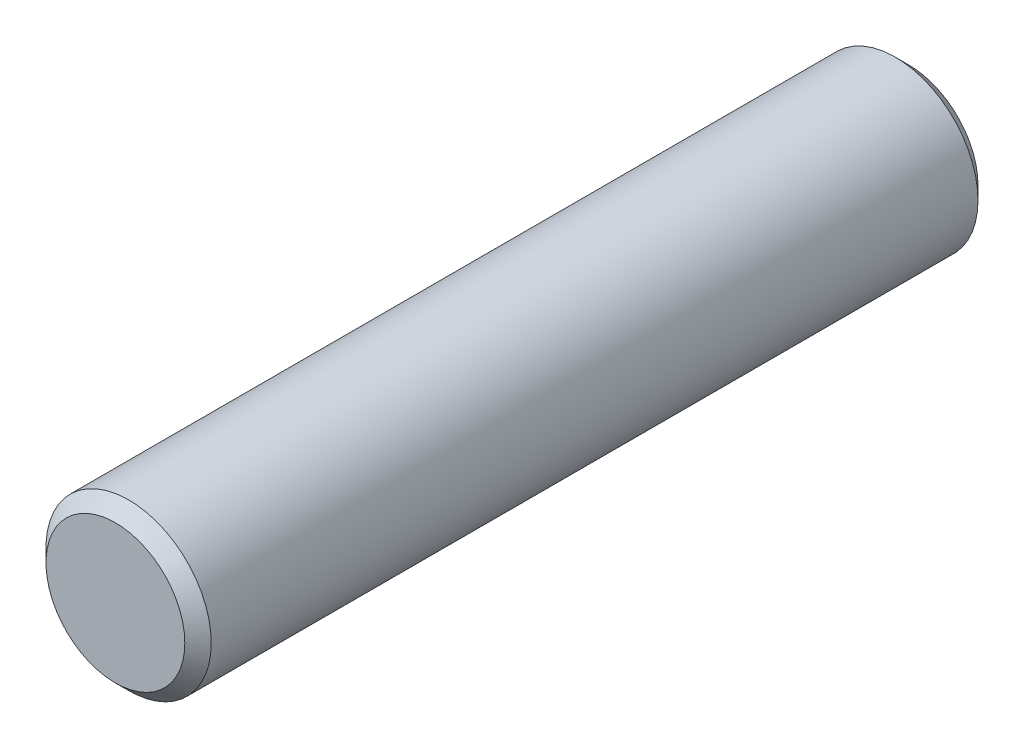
ISO-10303-21;
HEADER;
FILE_DESCRIPTION(('STEP AP214'),'2;1');
FILE_NAME('part.step','',(''),(''),'','','');
FILE_SCHEMA(('AUTOMOTIVE_DESIGN { 1 0 10303 214 1 1 1 1 }'));
ENDSEC;
DATA;
#1=APPLICATION_CONTEXT('core data for automotive mechanical design processes');
#2=APPLICATION_PROTOCOL_DEFINITION('international standard','automotive_design',2000,#1);
#3=PRODUCT_CONTEXT('',#1,'mechanical');
#4=PRODUCT('Part','Part','',(#3));
#5=PRODUCT_RELATED_PRODUCT_CATEGORY('part','',(#4));
#6=PRODUCT_DEFINITION_FORMATION('','',#4);
#7=PRODUCT_DEFINITION_CONTEXT('part definition',#1,'design');
#8=PRODUCT_DEFINITION('design','',#6,#7);
#9=PRODUCT_DEFINITION_SHAPE('','',#8);
#10=(LENGTH_UNIT() NAMED_UNIT(*) SI_UNIT(.MILLI.,.METRE.));
#11=(NAMED_UNIT(*) PLANE_ANGLE_UNIT() SI_UNIT($,.RADIAN.));
#12=(NAMED_UNIT(*) SI_UNIT($,.STERADIAN.) SOLID_ANGLE_UNIT());
#13=UNCERTAINTY_MEASURE_WITH_UNIT(LENGTH_MEASURE(1.E-05),#10,'distance_accuracy_value','');
#14=(GEOMETRIC_REPRESENTATION_CONTEXT(3) GLOBAL_UNCERTAINTY_ASSIGNED_CONTEXT((#13)) GLOBAL_UNIT_ASSIGNED_CONTEXT((#10,
#11,#12)) REPRESENTATION_CONTEXT('',''));
#15=CARTESIAN_POINT('',(0.,0.,0.));
#16=DIRECTION('',(0.,0.,1.));
#17=DIRECTION('',(1.,0.,0.));
#18=AXIS2_PLACEMENT_3D('',#15,#16,#17);
#19=CARTESIAN_POINT('',(0.,0.,-6.));
#20=DIRECTION('',(0.,0.,1.));
#21=DIRECTION('',(1.,0.,0.));
#22=AXIS2_PLACEMENT_3D('',#19,#20,#21);
#23=CYLINDRICAL_SURFACE('',#22,1.25);
#24=CARTESIAN_POINT('',(0.,0.,-5.8));
#25=DIRECTION('',(0.,0.,1.));
#26=DIRECTION('',(1.,0.,0.));
#27=AXIS2_PLACEMENT_3D('',#24,#25,#26);
#28=CIRCLE('',#27,1.25);
#29=CARTESIAN_POINT('',(1.25,0.,-5.8));
#30=VERTEX_POINT('',#29);
#31=EDGE_CURVE('E42',#30,#30,#28,.T.);
#32=ORIENTED_EDGE('',*,*,#31,.T.);
#33=EDGE_LOOP('',(#32));
#34=FACE_BOUND('',#33,.T.);
#35=CARTESIAN_POINT('',(0.,0.,5.8));
#36=DIRECTION('',(0.,0.,1.));
#37=DIRECTION('',(1.,0.,0.));
#38=AXIS2_PLACEMENT_3D('',#35,#36,#37);
#39=CIRCLE('',#38,1.25);
#40=CARTESIAN_POINT('',(1.25,0.,5.8));
#41=VERTEX_POINT('',#40);
#42=EDGE_CURVE('E46',#41,#41,#39,.F.);
#43=ORIENTED_EDGE('',*,*,#42,.T.);
#44=EDGE_LOOP('',(#43));
#45=FACE_BOUND('',#44,.T.);
#46=ADVANCED_FACE('F31',(#34,#45),#23,.T.);
#47=CARTESIAN_POINT('',(0.,0.,-6.));
#48=DIRECTION('',(0.,0.,1.));
#49=DIRECTION('',(1.,0.,0.));
#50=AXIS2_PLACEMENT_3D('',#47,#48,#49);
#51=PLANE('',#50);
#52=CARTESIAN_POINT('',(0.,0.,-6.));
#53=DIRECTION('',(0.,0.,1.));
#54=DIRECTION('',(1.,0.,0.));
#55=AXIS2_PLACEMENT_3D('',#52,#53,#54);
#56=CIRCLE('',#55,1.05);
#57=CARTESIAN_POINT('',(1.05,0.,-6.));
#58=VERTEX_POINT('',#57);
#59=EDGE_CURVE('E38',#58,#58,#56,.F.);
#60=ORIENTED_EDGE('',*,*,#59,.T.);
#61=EDGE_LOOP('',(#60));
#62=FACE_BOUND('',#61,.T.);
#63=ADVANCED_FACE('F62',(#62),#51,.F.);
#64=CARTESIAN_POINT('',(0.,0.,6.));
#65=DIRECTION('',(0.,0.,1.));
#66=DIRECTION('',(1.,0.,0.));
#67=AXIS2_PLACEMENT_3D('',#64,#65,#66);
#68=PLANE('',#67);
#69=CARTESIAN_POINT('',(0.,0.,6.));
#70=DIRECTION('',(0.,0.,1.));
#71=DIRECTION('',(1.,0.,0.));
#72=AXIS2_PLACEMENT_3D('',#69,#70,#71);
#73=CIRCLE('',#72,1.05);
#74=CARTESIAN_POINT('',(1.05,0.,6.));
#75=VERTEX_POINT('',#74);
#76=EDGE_CURVE('E10',#75,#75,#73,.T.);
#77=ORIENTED_EDGE('',*,*,#76,.T.);
#78=EDGE_LOOP('',(#77));
#79=FACE_BOUND('',#78,.T.);
#80=ADVANCED_FACE('F59',(#79),#68,.T.);
#81=CARTESIAN_POINT('',(0.,0.,-5.8));
#82=DIRECTION('',(0.,0.,1.));
#83=DIRECTION('',(1.,0.,0.));
#84=AXIS2_PLACEMENT_3D('',#81,#82,#83);
#85=CONICAL_SURFACE('',#84,1.25,0.785398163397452);
#86=ORIENTED_EDGE('',*,*,#59,.F.);
#87=EDGE_LOOP('',(#86));
#88=FACE_BOUND('',#87,.T.);
#89=ORIENTED_EDGE('',*,*,#31,.F.);
#90=EDGE_LOOP('',(#89));
#91=FACE_BOUND('',#90,.T.);
#92=ADVANCED_FACE('F55',(#88,#91),#85,.T.);
#93=CARTESIAN_POINT('',(0.,0.,6.));
#94=DIRECTION('',(0.,0.,-1.));
#95=DIRECTION('',(-1.,0.,0.));
#96=AXIS2_PLACEMENT_3D('',#93,#94,#95);
#97=CONICAL_SURFACE('',#96,1.05,0.78539816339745);
#98=ORIENTED_EDGE('',*,*,#42,.F.);
#99=EDGE_LOOP('',(#98));
#100=FACE_BOUND('',#99,.T.);
#101=ORIENTED_EDGE('',*,*,#76,.F.);
#102=EDGE_LOOP('',(#101));
#103=FACE_BOUND('',#102,.T.);
#104=ADVANCED_FACE('F33',(#100,#103),#97,.T.);
#105=CLOSED_SHELL('',(#46,#63,#80,#92,#104));
#106=MANIFOLD_SOLID_BREP('B2',#105);
#107=ADVANCED_BREP_SHAPE_REPRESENTATION('',(#18,#106),#14);
#108=SHAPE_DEFINITION_REPRESENTATION(#9,#107);
ENDSEC;
END-ISO-10303-21;
